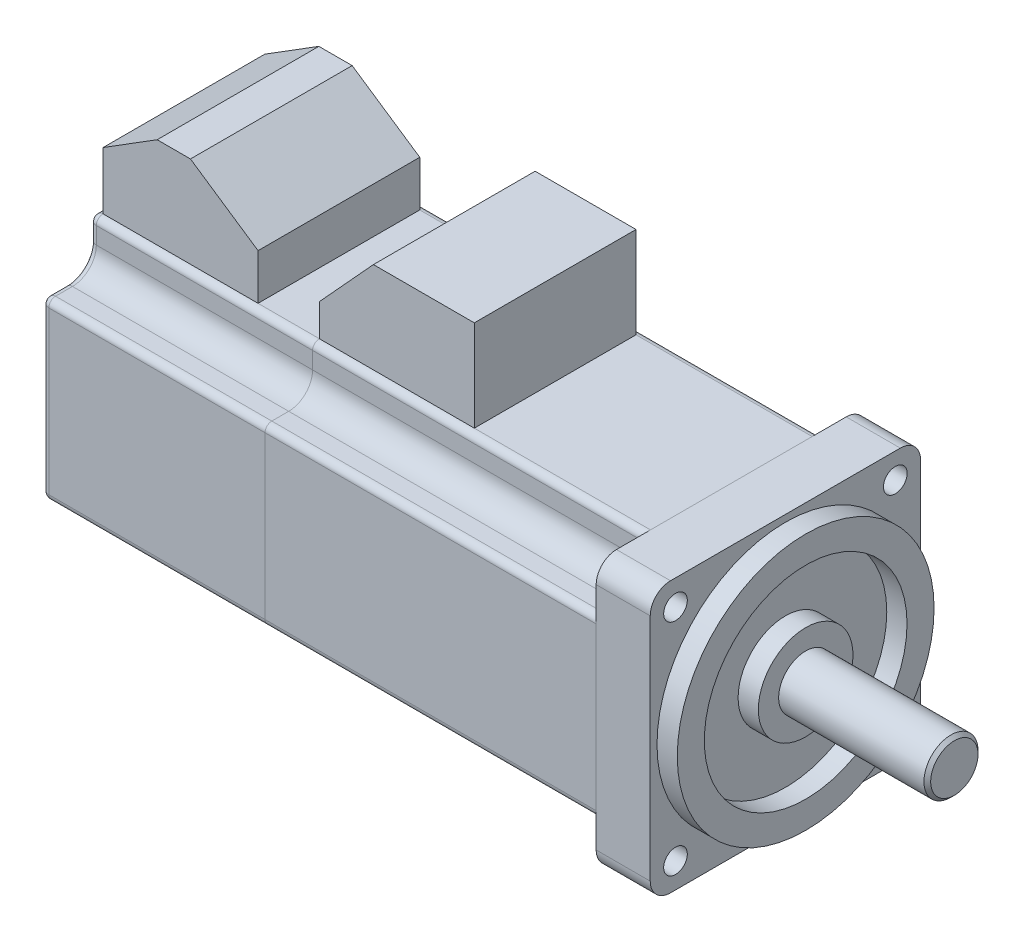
from build123d import *

# Parameters (mm, degrees)
EXTRUDE_1_DEPTH     = 33
EXTRUDE_2_DEPTH     = 49
EXTRUDE_3_DEPTH     = 8
CUT_EXTRUDE_1_DEPTH = 82
SKETCH_5_R          = 1.75
CUT_EXTRUDE_2_DEPTH = 8
FILLET_1_R          = 1
SKETCH_6_R          = 19
SKETCH_6_R_2        = 15
SKETCH_6_R_3        = 7
EXTRUDE_4_DEPTH     = 3
SKETCH_7_R          = 4
EXTRUDE_5_DEPTH     = 22
CHAMFER_1_SIZE      = 0.5
SKETCH_12_W         = 22.93
SKETCH_12_H         = 23.928932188
EXTRUDE_6_DEPTH     = 13.5
EXTRUDE_6_2_DEPTH   = 13.5
CUT_EXTRUDE_3_DEPTH = 23.93


with BuildPart() as part:
    # Sketch 1 → Extrude 1 (new body)
    with BuildSketch(Plane(origin=(0, 0, 0), x_dir=(0, 0, -1), z_dir=(1, 0, 0))):
        with BuildLine():
            Line((-17, -20), (17, -20))
            ThreePointArc((17, -20), (19.121320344, -19.121320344), (20, -17))
            Line((20, -17), (20, 17))
            ThreePointArc((20, 17), (19.121320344, 19.121320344), (17, 20))
            Line((17, 20), (-17, 20))
            ThreePointArc((-17, 20), (-19.121320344, 19.121320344), (-20, 17))
            Line((-20, 17), (-20, -17))
            ThreePointArc((-20, -17), (-19.121320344, -19.121320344), (-17, -20))
        make_face()
    extrude(amount=EXTRUDE_1_DEPTH)


with BuildPart() as body_2:
    # Sketch 2 → Extrude 2 (new body)
    with BuildSketch(Plane(origin=(33, 0, 0), x_dir=(0, 0, -1), z_dir=(1, 0, 0))):
        with BuildLine():
            Line((-17, -20), (17, -20))
            ThreePointArc((17, -20), (19.121320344, -19.121320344), (20, -17))
            Line((20, -17), (20, 17))
            ThreePointArc((20, 17), (19.121320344, 19.121320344), (17, 20))
            Line((17, 20), (-17, 20))
            ThreePointArc((-17, 20), (-19.121320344, 19.121320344), (-20, 17))
            Line((-20, 17), (-20, -17))
            ThreePointArc((-20, -17), (-19.121320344, -19.121320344), (-17, -20))
        make_face()
    extrude(amount=EXTRUDE_2_DEPTH)


with BuildPart() as body_3:
    # Sketch 3 → Extrude 3 (new body)
    with BuildSketch(Plane(origin=(82, 0, 0), x_dir=(0, 0, -1), z_dir=(1, 0, 0))):
        with BuildLine():
            Line((-17, -20), (17, -20))
            ThreePointArc((17, -20), (19.121320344, -19.121320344), (20, -17))
            Line((20, -17), (20, 17))
            ThreePointArc((20, 17), (19.121320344, 19.121320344), (17, 20))
            Line((17, 20), (-17, 20))
            ThreePointArc((-17, 20), (-19.121320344, 19.121320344), (-20, 17))
            Line((-20, 17), (-20, -17))
            ThreePointArc((-20, -17), (-19.121320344, -19.121320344), (-17, -20))
        make_face()
    extrude(amount=EXTRUDE_3_DEPTH)

    # Sketch 5 → Cut-Extrude 2 (cut)
    with BuildSketch(Plane(origin=(90, 0, 0), x_dir=(0, 0, -1), z_dir=(1, 0, 0))):
        with Locations((-16.263455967, 16.263455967)):
            Circle(SKETCH_5_R)
        with Locations((16.263455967, 16.263455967)):
            Circle(SKETCH_5_R)
        with Locations((16.263455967, -16.263455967)):
            Circle(SKETCH_5_R)
        with Locations((-16.263455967, -16.263455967)):
            Circle(SKETCH_5_R)
    extrude(amount=-CUT_EXTRUDE_2_DEPTH, mode=Mode.SUBTRACT)

    # Sketch 6 → Extrude 4 (add)
    # profile 1 of 2: a face of its own
    with BuildSketch(Plane(origin=(90, 0, 0), x_dir=(0, 0, -1), z_dir=(1, 0, 0))):
        with Locations(Location((0, 0, 0), (0, 0, 180))):
            Circle(SKETCH_6_R)
        Circle(SKETCH_6_R_2, mode=Mode.SUBTRACT)
    # profile 2 of 2: a face of its own
    with BuildSketch(Plane(origin=(90, 0, 0), x_dir=(0, 0, -1), z_dir=(1, 0, 0))):
        with Locations(Location((0, 0, 0), (0, 0, 180))):
            Circle(SKETCH_6_R_3)
    extrude(amount=EXTRUDE_4_DEPTH)


with BuildPart() as cut_extrude_1_tool:
    # Sketch 4 → Cut-Extrude 1 (new body)
    with BuildSketch(Plane.ZY):
        with BuildLine():
            Line((-16.5, 12.964466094), (-19, 12.964466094))
            ThreePointArc((-19, 12.964466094), (-19.707106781, 12.671572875), (-20, 11.964466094))
            Line((-20, 11.964466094), (-20, 17))
            ThreePointArc((-20, 17), (-19.121320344, 19.121320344), (-17, 20))
            Line((-17, 20), (-11.964466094, 20))
            ThreePointArc((-11.964466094, 20), (-12.671572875, 19.707106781), (-12.964466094, 19))
            Line((-12.964466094, 19), (-12.964466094, 16.5))
            ThreePointArc((-12.964466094, 16.5), (-14, 14), (-16.5, 12.964466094))
        make_face()
        with BuildLine():
            Line((11.964466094, 20), (17, 20))
            ThreePointArc((17, 20), (19.121320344, 19.121320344), (20, 17))
            Line((20, 17), (20, 11.964466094))
            ThreePointArc((20, 11.964466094), (19.707106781, 12.671572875), (19, 12.964466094))
            Line((19, 12.964466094), (16.5, 12.964466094))
            ThreePointArc((16.5, 12.964466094), (14, 14), (12.964466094, 16.5))
            Line((12.964466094, 16.5), (12.964466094, 19))
            ThreePointArc((12.964466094, 19), (12.671572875, 19.707106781), (11.964466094, 20))
        make_face()
        with BuildLine():
            Line((20, -11.964466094), (20, -17))
            ThreePointArc((20, -17), (19.121320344, -19.121320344), (17, -20))
            Line((17, -20), (11.964466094, -20))
            ThreePointArc((11.964466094, -20), (12.671572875, -19.707106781), (12.964466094, -19))
            Line((12.964466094, -19), (12.964466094, -16.5))
            ThreePointArc((12.964466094, -16.5), (14, -14), (16.5, -12.964466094))
            Line((16.5, -12.964466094), (19, -12.964466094))
            ThreePointArc((19, -12.964466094), (19.707106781, -12.671572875), (20, -11.964466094))
        make_face()
        with BuildLine():
            Line((-19, -12.964466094), (-16.5, -12.964466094))
            ThreePointArc((-16.5, -12.964466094), (-14, -14), (-12.964466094, -16.5))
            Line((-12.964466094, -16.5), (-12.964466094, -19))
            ThreePointArc((-12.964466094, -19), (-12.671572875, -19.707106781), (-11.964466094, -20))
            Line((-11.964466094, -20), (-17, -20))
            ThreePointArc((-17, -20), (-19.121320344, -19.121320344), (-20, -17))
            Line((-20, -17), (-20, -11.964466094))
            ThreePointArc((-20, -11.964466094), (-19.707106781, -12.671572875), (-19, -12.964466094))
        make_face()
    extrude(amount=-CUT_EXTRUDE_1_DEPTH)


with BuildPart() as part_1:
    add(part.part)

    # Cut-Extrude 1: cut by cut_extrude_1_tool
    add(cut_extrude_1_tool.part, mode=Mode.SUBTRACT)

    # Fillet 1
    fillet_1_edges = [part_1.edges().sort_by_distance(p)[0] for p in [
        (0, 14, 14),
        (0, 12.964466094, 17.75),
        (0, 12.671572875, 19.707106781),
        (0, 19.707106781, 12.671572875),
        (0, 17.75, 12.964466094),
        (0, 20, 0),
        (0, 0, -20),
        (0, -20, 0),
        (0, 0, 20),
        (0, 19.707106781, -12.671572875),
        (0, 12.671572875, -19.707106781),
        (0, 12.964466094, -17.75),
        (0, 14, -14),
        (0, 17.75, -12.964466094),
        (0, -14, -14),
        (0, -12.964466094, -17.75),
        (0, -12.671572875, -19.707106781),
        (0, -19.707106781, -12.671572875),
        (0, -17.75, -12.964466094),
        (0, -14, 14),
        (0, -17.75, 12.964466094),
        (0, -19.707106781, 12.671572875),
        (0, -12.671572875, 19.707106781),
        (0, -12.964466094, 17.75),
    ]]
    fillet(fillet_1_edges, radius=FILLET_1_R)


with BuildPart() as body_2_1:
    add(body_2.part)

    # Cut-Extrude 1: cut by cut_extrude_1_tool
    add(cut_extrude_1_tool.part, mode=Mode.SUBTRACT)


with BuildPart() as body_4:
    # Sketch 7 → Extrude 5 (new body)
    with BuildSketch(Plane(origin=(93, 0, 0), x_dir=(0, 0, -1), z_dir=(1, 0, 0))):
        Circle(SKETCH_7_R)
    extrude(amount=EXTRUDE_5_DEPTH)

    # Chamfer 1
    chamfer_1_edges = [body_4.edges().sort_by_distance(p)[0] for p in [
        (115, 0, 4),
    ]]
    chamfer(chamfer_1_edges, length=CHAMFER_1_SIZE)


with BuildPart() as body_5:
    # Sketch 12 → Extrude 6 (new body)
    with BuildSketch(Plane(origin=(0, 20, 0), x_dir=(1, 0, 0), z_dir=(0, 1, 0))):
        with Locations((44.465, 0)):
            Rectangle(SKETCH_12_W, SKETCH_12_H)
    extrude(amount=EXTRUDE_6_DEPTH)


with BuildPart() as body_6:
    # Sketch 12 → Extrude 6 2 (new body)
    with BuildSketch(Plane(origin=(0, 20, 0), x_dir=(1, 0, 0), z_dir=(0, 1, 0))):
        with Locations((12.465, 0)):
            Rectangle(SKETCH_12_W, SKETCH_12_H)
    extrude(amount=EXTRUDE_6_2_DEPTH)


with BuildPart() as cut_extrude_3_tool:
    # Sketch 13 → Cut-Extrude 3 (new body)
    with BuildSketch(Plane.XY.offset(11.964466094)):
        Polygon((1, 33.5), (1, 28.5), (9, 33.5), align=None)
        Polygon((23.93, 33.5), (13.93, 33.5), (23.93, 26.75), align=None)
        Polygon((33, 33.5), (41, 33.5), (33, 24.750823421), align=None)
    extrude(amount=-CUT_EXTRUDE_3_DEPTH)


with BuildPart() as body_5_1:
    add(body_5.part)

    # Cut-Extrude 3: cut by cut_extrude_3_tool
    add(cut_extrude_3_tool.part, mode=Mode.SUBTRACT)


with BuildPart() as body_6_1:
    add(body_6.part)

    # Cut-Extrude 3: cut by cut_extrude_3_tool
    add(cut_extrude_3_tool.part, mode=Mode.SUBTRACT)


solid = Compound([body_3.part, part_1.part, body_2_1.part, body_4.part, body_5_1.part, body_6_1.part])
